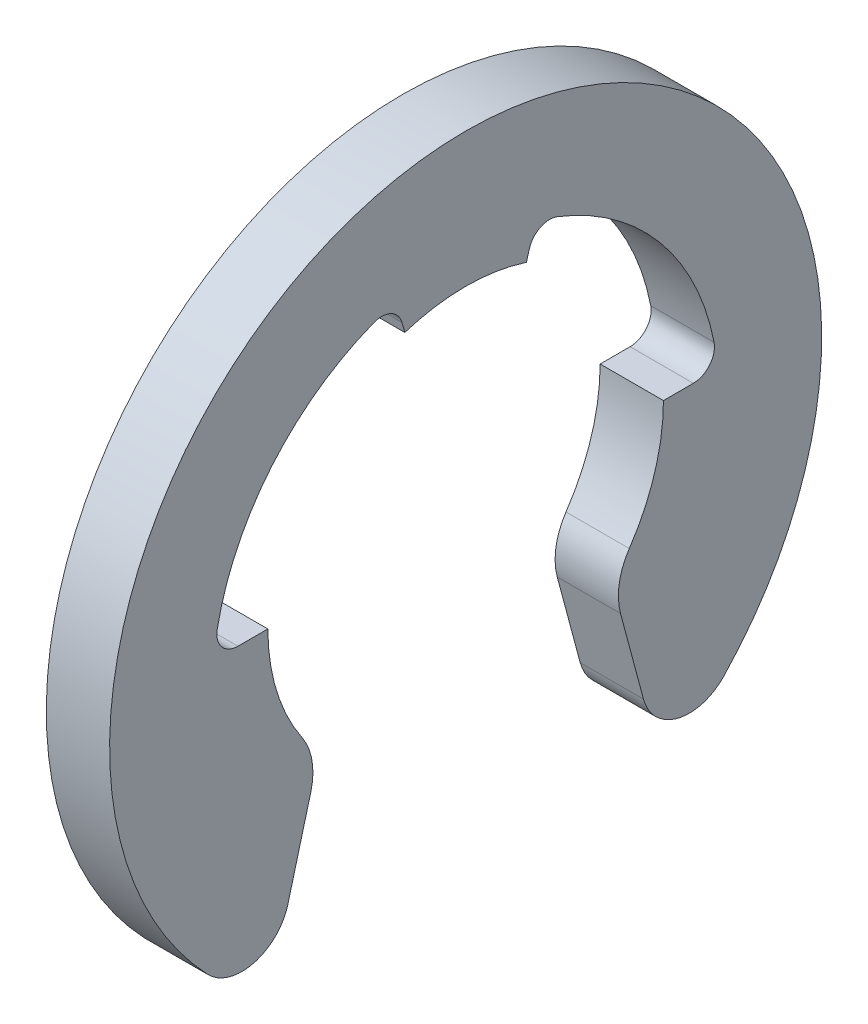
from build123d import *

# Parameters (mm, degrees)
BASE_EXTRUSION_DEPTH = 0.4


with BuildPart() as part:
    # Esquisse1 → Base-Extrusion (new body)
    with BuildSketch(Plane(origin=(0, 0, 0), x_dir=(0, 0, -1), z_dir=(1, 0, 0))):
        with BuildLine():
            Line((0.384102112, 1.339523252), (0.402594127, 1.404012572))
            ThreePointArc((0.402594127, 1.404012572), (0.471494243, 1.486697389), (0.579013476, 1.491557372))
            ThreePointArc((0.579013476, 1.491557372), (1.226365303, 1.0276323), (1.569860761, 0.309090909))
            ThreePointArc((1.569860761, 0.309090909), (1.542024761, 0.198647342), (1.439039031, 0.15))
            Line((1.439039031, 0.15), (1.25, 0.15))
            ThreePointArc((1.25, 0.15), (1.194850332, -0.217195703), (1.034267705, -0.551990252))
            ThreePointArc((1.034267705, -0.551990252), (0.97081517, -0.710036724), (0.97886304, -0.880154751))
            Line((0.97886304, -0.880154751), (1.123762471, -1.42092679))
            ThreePointArc((1.123762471, -1.42092679), (1.339592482, -1.634024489), (1.631007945, -1.549939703))
            ThreePointArc((1.631007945, -1.549939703), (0, 2.25), (-1.631007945, -1.549939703))
            ThreePointArc((-1.631007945, -1.549939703), (-1.339592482, -1.634024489), (-1.123762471, -1.42092679))
            Line((-1.123762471, -1.42092679), (-0.97886304, -0.880154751))
            ThreePointArc((-0.97886304, -0.880154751), (-0.97081517, -0.710036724), (-1.034267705, -0.551990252))
            ThreePointArc((-1.034267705, -0.551990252), (-1.194850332, -0.217195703), (-1.25, 0.15))
            Line((-1.25, 0.15), (-1.439039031, 0.15))
            ThreePointArc((-1.439039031, 0.15), (-1.542024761, 0.198647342), (-1.569860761, 0.309090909))
            ThreePointArc((-1.569860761, 0.309090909), (-1.226365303, 1.0276323), (-0.579013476, 1.491557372))
            ThreePointArc((-0.579013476, 1.491557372), (-0.471494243, 1.486697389), (-0.402594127, 1.404012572))
            Line((-0.402594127, 1.404012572), (-0.384102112, 1.339523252))
            ThreePointArc((-0.384102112, 1.339523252), (0, 1.4), (0.384102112, 1.339523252))
        make_face()
    extrude(amount=BASE_EXTRUSION_DEPTH)


solid = part.part
